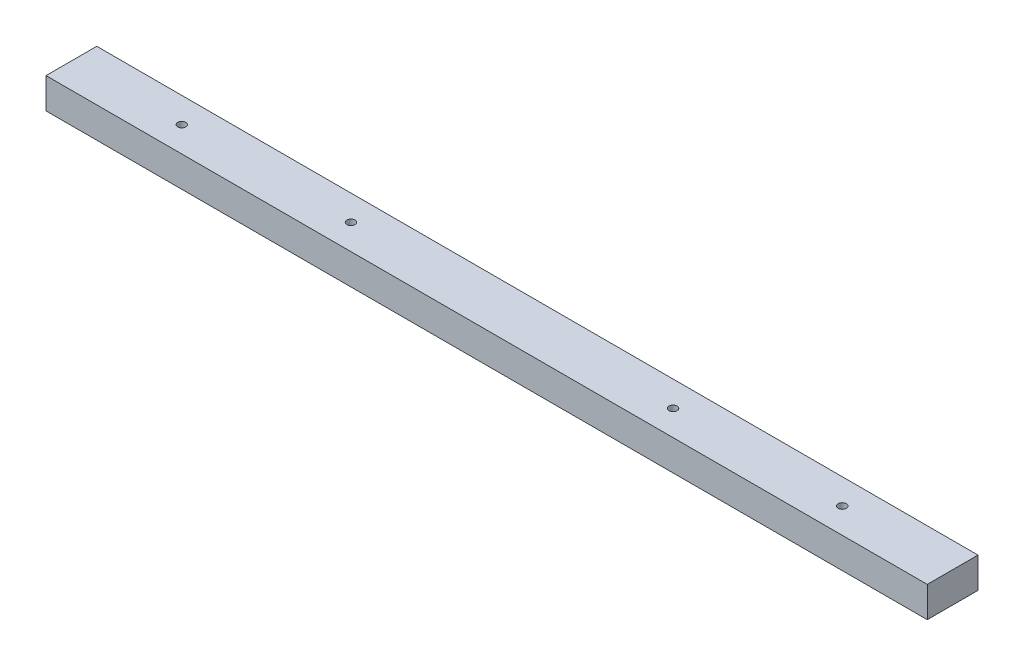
from build123d import *

# Parameters (mm, degrees)
SKETCH1_W           = 1220
SKETCH1_H           = 63
BOSS_EXTRUDE1_DEPTH = 38
SKETCH2_R           = 5
CUT_EXTRUDE1_DEPTH  = 38
CUT_EXTRUDE2_REACH  = 1224.216
SKETCH3_W           = 63
SKETCH3_H           = 63


with BuildPart() as part:
    # Sketch1 → Boss-Extrude1 (new body)
    with BuildSketch(Plane(origin=(0, 0, 0), x_dir=(1, 0, 0), z_dir=(0, 1, 0))):
        with Locations((610, 31.5)):
            Rectangle(SKETCH1_W, SKETCH1_H)
    extrude(amount=BOSS_EXTRUDE1_DEPTH)

    # Sketch2 → Cut-Extrude1 (cut)
    with BuildSketch(Plane(origin=(0, 38, 0), x_dir=(1, 0, 0), z_dir=(0, 1, 0))):
        with Locations(Location((200, 31.5, 0), (0, 0, 270))):
            Circle(SKETCH2_R)
        with Locations(Location((410, 31.5, 0), (0, 0, 270))):
            Circle(SKETCH2_R)
        with Locations(Location((810, 31.5, 0), (0, 0, 90))):
            Circle(SKETCH2_R)
        with Locations(Location((1020, 31.5, 0), (0, 0, 90))):
            Circle(SKETCH2_R)
    extrude(amount=-CUT_EXTRUDE1_DEPTH, mode=Mode.SUBTRACT)

    # Sketch3 → Cut-Extrude2 (cut, up to next)
    with BuildSketch(Plane(origin=(0, 38, 0), x_dir=(1, 0, 0), z_dir=(0, 1, 0)), mode=Mode.PRIVATE) as cut_extrude2_sk1:
        with Locations((31.5, 31.5)):
            Rectangle(SKETCH3_W, SKETCH3_H)
    cut_extrude2_tool1 = extrude(cut_extrude2_sk1.sketch, amount=-CUT_EXTRUDE2_REACH, mode=Mode.PRIVATE) & part.part
    # Sketch3 → Cut-Extrude2 (cut, up to next)
    with BuildSketch(Plane(origin=(0, 38, 0), x_dir=(1, 0, 0), z_dir=(0, 1, 0)), mode=Mode.PRIVATE) as cut_extrude2_sk2:
        with Locations((1188.5, 31.5)):
            Rectangle(SKETCH3_W, SKETCH3_H)
    cut_extrude2_tool2 = extrude(cut_extrude2_sk2.sketch, amount=-CUT_EXTRUDE2_REACH, mode=Mode.PRIVATE) & part.part
    add(cut_extrude2_tool1.solids().sort_by_distance((31.5, 38, -31.5))[0], mode=Mode.SUBTRACT)
    add(cut_extrude2_tool2.solids().sort_by_distance((1188.5, 38, -31.5))[0], mode=Mode.SUBTRACT)


solid = part.part
